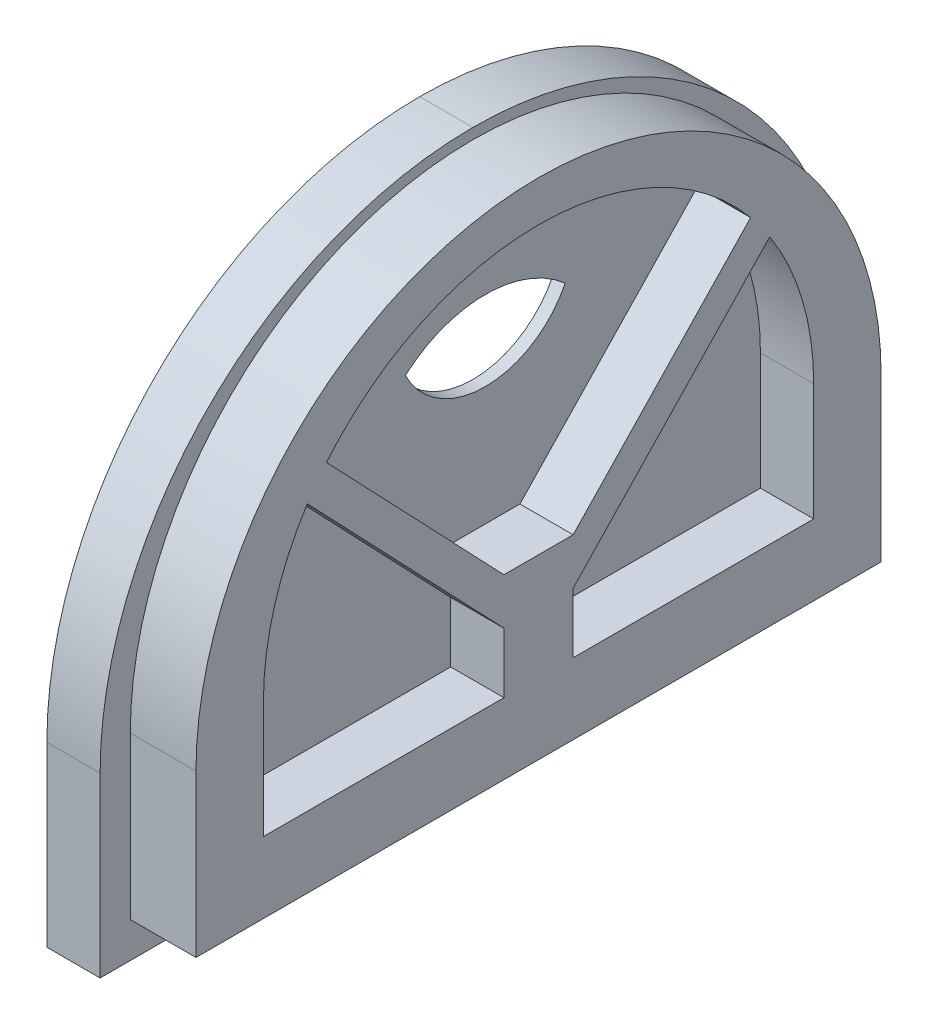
ISO-10303-21;
HEADER;
FILE_DESCRIPTION(('STEP AP214'),'2;1');
FILE_NAME('part.step','',(''),(''),'','','');
FILE_SCHEMA(('AUTOMOTIVE_DESIGN { 1 0 10303 214 1 1 1 1 }'));
ENDSEC;
DATA;
#1=APPLICATION_CONTEXT('core data for automotive mechanical design processes');
#2=APPLICATION_PROTOCOL_DEFINITION('international standard','automotive_design',2000,#1);
#3=PRODUCT_CONTEXT('',#1,'mechanical');
#4=PRODUCT('Part','Part','',(#3));
#5=PRODUCT_RELATED_PRODUCT_CATEGORY('part','',(#4));
#6=PRODUCT_DEFINITION_FORMATION('','',#4);
#7=PRODUCT_DEFINITION_CONTEXT('part definition',#1,'design');
#8=PRODUCT_DEFINITION('design','',#6,#7);
#9=PRODUCT_DEFINITION_SHAPE('','',#8);
#10=(LENGTH_UNIT() NAMED_UNIT(*) SI_UNIT(.MILLI.,.METRE.));
#11=(NAMED_UNIT(*) PLANE_ANGLE_UNIT() SI_UNIT($,.RADIAN.));
#12=(NAMED_UNIT(*) SI_UNIT($,.STERADIAN.) SOLID_ANGLE_UNIT());
#13=UNCERTAINTY_MEASURE_WITH_UNIT(LENGTH_MEASURE(1.E-05),#10,'distance_accuracy_value','');
#14=(GEOMETRIC_REPRESENTATION_CONTEXT(3) GLOBAL_UNCERTAINTY_ASSIGNED_CONTEXT((#13)) GLOBAL_UNIT_ASSIGNED_CONTEXT((#10,
#11,#12)) REPRESENTATION_CONTEXT('',''));
#15=CARTESIAN_POINT('',(0.,0.,0.));
#16=DIRECTION('',(0.,0.,1.));
#17=DIRECTION('',(1.,0.,0.));
#18=AXIS2_PLACEMENT_3D('',#15,#16,#17);
#19=CARTESIAN_POINT('',(3.,-5.1,0.));
#20=DIRECTION('',(1.,0.,0.));
#21=DIRECTION('',(0.,0.,-1.));
#22=AXIS2_PLACEMENT_3D('',#19,#20,#21);
#23=PLANE('',#22);
#24=CARTESIAN_POINT('',(3.,0.89411764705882,0.));
#25=DIRECTION('',(1.,0.,0.));
#26=DIRECTION('',(0.,0.,-1.));
#27=AXIS2_PLACEMENT_3D('',#24,#25,#26);
#28=CIRCLE('',#27,6.80588235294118);
#29=CARTESIAN_POINT('',(3.,6.,-4.5));
#30=VERTEX_POINT('',#29);
#31=CARTESIAN_POINT('',(3.,6.,4.5));
#32=VERTEX_POINT('',#31);
#33=EDGE_CURVE('E287',#30,#32,#28,.T.);
#34=ORIENTED_EDGE('',*,*,#33,.T.);
#35=CARTESIAN_POINT('',(3.,8.21607142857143,0.));
#36=DIRECTION('',(1.,0.,0.));
#37=DIRECTION('',(0.,0.,-1.));
#38=AXIS2_PLACEMENT_3D('',#35,#36,#37);
#39=CIRCLE('',#38,5.01607142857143);
#40=EDGE_CURVE('E285',#32,#30,#39,.T.);
#41=ORIENTED_EDGE('',*,*,#40,.T.);
#42=EDGE_LOOP('',(#34,#41));
#43=FACE_BOUND('',#42,.T.);
#44=CARTESIAN_POINT('',(3.,-5.1,0.));
#45=DIRECTION('',(-1.,0.,0.));
#46=DIRECTION('',(0.,0.,-1.));
#47=AXIS2_PLACEMENT_3D('',#44,#45,#46);
#48=CIRCLE('',#47,16.);
#49=CARTESIAN_POINT('',(3.,6.34752931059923,11.1782857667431));
#50=VERTEX_POINT('',#49);
#51=CARTESIAN_POINT('',(3.,6.34752931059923,-11.1782857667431));
#52=VERTEX_POINT('',#51);
#53=EDGE_CURVE('E438',#50,#52,#48,.T.);
#54=ORIENTED_EDGE('',*,*,#53,.T.);
#55=DIRECTION('',(0.,-0.787301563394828,0.616568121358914));
#56=VECTOR('',#55,1.);
#57=CARTESIAN_POINT('',(3.,-5.5,-1.9));
#58=LINE('',#57,#56);
#59=CARTESIAN_POINT('',(3.,-5.5,-1.9));
#60=VERTEX_POINT('',#59);
#61=EDGE_CURVE('E302',#52,#60,#58,.T.);
#62=ORIENTED_EDGE('',*,*,#61,.T.);
#63=DIRECTION('',(0.,0.,-1.));
#64=VECTOR('',#63,1.);
#65=CARTESIAN_POINT('',(3.,-5.5,-1.9));
#66=LINE('',#65,#64);
#67=CARTESIAN_POINT('',(3.,-5.5,1.9));
#68=VERTEX_POINT('',#67);
#69=EDGE_CURVE('E339',#68,#60,#66,.T.);
#70=ORIENTED_EDGE('',*,*,#69,.F.);
#71=DIRECTION('',(0.,-0.787301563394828,-0.616568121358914));
#72=VECTOR('',#71,1.);
#73=CARTESIAN_POINT('',(3.,-5.5,1.9));
#74=LINE('',#73,#72);
#75=EDGE_CURVE('E324',#50,#68,#74,.T.);
#76=ORIENTED_EDGE('',*,*,#75,.F.);
#77=EDGE_LOOP('',(#54,#62,#70,#76));
#78=FACE_BOUND('',#77,.T.);
#79=ADVANCED_FACE('F34',(#43,#78),#23,.F.);
#80=CARTESIAN_POINT('',(3.,-5.1,0.));
#81=DIRECTION('',(-1.,0.,0.));
#82=DIRECTION('',(0.,0.,1.));
#83=AXIS2_PLACEMENT_3D('',#80,#81,#82);
#84=CYLINDRICAL_SURFACE('',#83,16.);
#85=CARTESIAN_POINT('',(0.,-5.1,0.));
#86=DIRECTION('',(-1.,0.,0.));
#87=DIRECTION('',(0.,0.,-1.));
#88=AXIS2_PLACEMENT_3D('',#85,#86,#87);
#89=CIRCLE('',#88,16.);
#90=CARTESIAN_POINT('',(0.,6.34752931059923,11.1782857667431));
#91=VERTEX_POINT('',#90);
#92=CARTESIAN_POINT('',(0.,6.34752931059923,-11.1782857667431));
#93=VERTEX_POINT('',#92);
#94=EDGE_CURVE('E450',#91,#93,#89,.T.);
#95=ORIENTED_EDGE('',*,*,#94,.T.);
#96=DIRECTION('',(1.,0.,0.));
#97=VECTOR('',#96,1.);
#98=CARTESIAN_POINT('',(0.,6.34752931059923,-11.1782857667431));
#99=LINE('',#98,#97);
#100=EDGE_CURVE('E318',#93,#52,#99,.T.);
#101=ORIENTED_EDGE('',*,*,#100,.T.);
#102=ORIENTED_EDGE('',*,*,#53,.F.);
#103=DIRECTION('',(1.,0.,0.));
#104=VECTOR('',#103,1.);
#105=CARTESIAN_POINT('',(0.,6.34752931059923,11.1782857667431));
#106=LINE('',#105,#104);
#107=EDGE_CURVE('E326',#91,#50,#106,.T.);
#108=ORIENTED_EDGE('',*,*,#107,.F.);
#109=EDGE_LOOP('',(#95,#101,#102,#108));
#110=FACE_BOUND('',#109,.T.);
#111=ADVANCED_FACE('F601',(#110),#84,.F.);
#112=DIRECTION('',(0.,0.787301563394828,0.616568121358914));
#113=VECTOR('',#112,1.);
#114=CARTESIAN_POINT('',(3.,-8.41938544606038,1.9));
#115=LINE('',#114,#113);
#116=CARTESIAN_POINT('',(3.,-8.41938544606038,1.9));
#117=VERTEX_POINT('',#116);
#118=CARTESIAN_POINT('',(3.,5.,12.4092707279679));
#119=VERTEX_POINT('',#118);
#120=EDGE_CURVE('E320',#117,#119,#115,.T.);
#121=ORIENTED_EDGE('',*,*,#120,.F.);
#122=DIRECTION('',(0.,1.,0.));
#123=VECTOR('',#122,1.);
#124=CARTESIAN_POINT('',(3.,-10.5,1.9));
#125=LINE('',#124,#123);
#126=CARTESIAN_POINT('',(3.,-10.5,1.9));
#127=VERTEX_POINT('',#126);
#128=EDGE_CURVE('E346',#127,#117,#125,.T.);
#129=ORIENTED_EDGE('',*,*,#128,.F.);
#130=DIRECTION('',(0.,0.,1.));
#131=VECTOR('',#130,1.);
#132=CARTESIAN_POINT('',(3.,-10.5,-16.));
#133=LINE('',#132,#131);
#134=CARTESIAN_POINT('',(3.,-10.5,16.));
#135=VERTEX_POINT('',#134);
#136=EDGE_CURVE('E425',#127,#135,#133,.T.);
#137=ORIENTED_EDGE('',*,*,#136,.T.);
#138=DIRECTION('',(0.,1.,0.));
#139=VECTOR('',#138,1.);
#140=CARTESIAN_POINT('',(3.,-5.1,16.));
#141=LINE('',#140,#139);
#142=CARTESIAN_POINT('',(3.,-5.1,16.));
#143=VERTEX_POINT('',#142);
#144=EDGE_CURVE('E430',#135,#143,#141,.T.);
#145=ORIENTED_EDGE('',*,*,#144,.T.);
#146=EDGE_CURVE('E434',#143,#119,#48,.T.);
#147=ORIENTED_EDGE('',*,*,#146,.T.);
#148=EDGE_LOOP('',(#121,#129,#137,#145,#147));
#149=FACE_BOUND('',#148,.T.);
#150=ADVANCED_FACE('F605',(#149),#23,.F.);
#151=DIRECTION('',(0.,-1.,0.));
#152=VECTOR('',#151,1.);
#153=CARTESIAN_POINT('',(3.,-10.5,-1.9));
#154=LINE('',#153,#152);
#155=CARTESIAN_POINT('',(3.,-8.41938544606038,-1.9));
#156=VERTEX_POINT('',#155);
#157=CARTESIAN_POINT('',(3.,-10.5,-1.9));
#158=VERTEX_POINT('',#157);
#159=EDGE_CURVE('E335',#156,#158,#154,.T.);
#160=ORIENTED_EDGE('',*,*,#159,.F.);
#161=DIRECTION('',(0.,0.787301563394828,-0.616568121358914));
#162=VECTOR('',#161,1.);
#163=CARTESIAN_POINT('',(3.,-8.41938544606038,-1.9));
#164=LINE('',#163,#162);
#165=CARTESIAN_POINT('',(3.,5.,-12.4092707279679));
#166=VERTEX_POINT('',#165);
#167=EDGE_CURVE('E307',#156,#166,#164,.T.);
#168=ORIENTED_EDGE('',*,*,#167,.T.);
#169=CARTESIAN_POINT('',(3.,-5.1,-16.));
#170=VERTEX_POINT('',#169);
#171=EDGE_CURVE('E433',#166,#170,#48,.T.);
#172=ORIENTED_EDGE('',*,*,#171,.T.);
#173=DIRECTION('',(0.,-1.,0.));
#174=VECTOR('',#173,1.);
#175=CARTESIAN_POINT('',(3.,-10.5,-16.));
#176=LINE('',#175,#174);
#177=CARTESIAN_POINT('',(3.,-10.5,-16.));
#178=VERTEX_POINT('',#177);
#179=EDGE_CURVE('E422',#170,#178,#176,.T.);
#180=ORIENTED_EDGE('',*,*,#179,.T.);
#181=EDGE_CURVE('E427',#178,#158,#133,.T.);
#182=ORIENTED_EDGE('',*,*,#181,.T.);
#183=EDGE_LOOP('',(#160,#168,#172,#180,#182));
#184=FACE_BOUND('',#183,.T.);
#185=ADVANCED_FACE('F604',(#184),#23,.F.);
#186=DIRECTION('',(1.,0.,0.));
#187=VECTOR('',#186,1.);
#188=CARTESIAN_POINT('',(0.,5.,12.4092707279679));
#189=LINE('',#188,#187);
#190=CARTESIAN_POINT('',(0.,5.,12.4092707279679));
#191=VERTEX_POINT('',#190);
#192=EDGE_CURVE('E330',#191,#119,#189,.T.);
#193=ORIENTED_EDGE('',*,*,#192,.T.);
#194=ORIENTED_EDGE('',*,*,#146,.F.);
#195=DIRECTION('',(-1.,0.,0.));
#196=VECTOR('',#195,1.);
#197=CARTESIAN_POINT('',(3.,-5.1,16.));
#198=LINE('',#197,#196);
#199=CARTESIAN_POINT('',(0.,-5.1,16.));
#200=VERTEX_POINT('',#199);
#201=EDGE_CURVE('E455',#143,#200,#198,.T.);
#202=ORIENTED_EDGE('',*,*,#201,.T.);
#203=EDGE_CURVE('E426',#200,#191,#89,.T.);
#204=ORIENTED_EDGE('',*,*,#203,.T.);
#205=EDGE_LOOP('',(#193,#194,#202,#204));
#206=FACE_BOUND('',#205,.T.);
#207=ADVANCED_FACE('F612',(#206),#84,.F.);
#208=ORIENTED_EDGE('',*,*,#171,.F.);
#209=DIRECTION('',(1.,0.,0.));
#210=VECTOR('',#209,1.);
#211=CARTESIAN_POINT('',(0.,5.,-12.4092707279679));
#212=LINE('',#211,#210);
#213=CARTESIAN_POINT('',(0.,5.,-12.4092707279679));
#214=VERTEX_POINT('',#213);
#215=EDGE_CURVE('E315',#214,#166,#212,.T.);
#216=ORIENTED_EDGE('',*,*,#215,.F.);
#217=CARTESIAN_POINT('',(0.,-5.1,-16.));
#218=VERTEX_POINT('',#217);
#219=EDGE_CURVE('E447',#214,#218,#89,.T.);
#220=ORIENTED_EDGE('',*,*,#219,.T.);
#221=DIRECTION('',(-1.,0.,0.));
#222=VECTOR('',#221,1.);
#223=CARTESIAN_POINT('',(3.,-5.1,-16.));
#224=LINE('',#223,#222);
#225=EDGE_CURVE('E451',#170,#218,#224,.T.);
#226=ORIENTED_EDGE('',*,*,#225,.F.);
#227=EDGE_LOOP('',(#208,#216,#220,#226));
#228=FACE_BOUND('',#227,.T.);
#229=ADVANCED_FACE('F611',(#228),#84,.F.);
#230=CARTESIAN_POINT('',(0.,-10.5,1.9));
#231=DIRECTION('',(0.,0.,-1.));
#232=DIRECTION('',(0.,1.,0.));
#233=AXIS2_PLACEMENT_3D('',#230,#231,#232);
#234=PLANE('',#233);
#235=DIRECTION('',(1.,0.,0.));
#236=VECTOR('',#235,1.);
#237=CARTESIAN_POINT('',(0.,-8.41938544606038,1.9));
#238=LINE('',#237,#236);
#239=CARTESIAN_POINT('',(0.,-8.41938544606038,1.9));
#240=VERTEX_POINT('',#239);
#241=EDGE_CURVE('E333',#240,#117,#238,.T.);
#242=ORIENTED_EDGE('',*,*,#241,.F.);
#243=DIRECTION('',(0.,1.,0.));
#244=VECTOR('',#243,1.);
#245=CARTESIAN_POINT('',(0.,-10.5,1.9));
#246=LINE('',#245,#244);
#247=CARTESIAN_POINT('',(0.,-10.5,1.9));
#248=VERTEX_POINT('',#247);
#249=EDGE_CURVE('E338',#248,#240,#246,.T.);
#250=ORIENTED_EDGE('',*,*,#249,.F.);
#251=DIRECTION('',(1.,0.,0.));
#252=VECTOR('',#251,1.);
#253=CARTESIAN_POINT('',(0.,-10.5,1.9));
#254=LINE('',#253,#252);
#255=EDGE_CURVE('E355',#248,#127,#254,.T.);
#256=ORIENTED_EDGE('',*,*,#255,.T.);
#257=ORIENTED_EDGE('',*,*,#128,.T.);
#258=EDGE_LOOP('',(#242,#250,#256,#257));
#259=FACE_BOUND('',#258,.T.);
#260=ADVANCED_FACE('F628',(#259),#234,.F.);
#261=CARTESIAN_POINT('',(3.,-10.5,-16.));
#262=DIRECTION('',(0.,-1.,0.));
#263=DIRECTION('',(0.,0.,-1.));
#264=AXIS2_PLACEMENT_3D('',#261,#262,#263);
#265=PLANE('',#264);
#266=DIRECTION('',(1.,0.,0.));
#267=VECTOR('',#266,1.);
#268=CARTESIAN_POINT('',(0.,-10.5,-1.9));
#269=LINE('',#268,#267);
#270=CARTESIAN_POINT('',(0.,-10.5,-1.9));
#271=VERTEX_POINT('',#270);
#272=EDGE_CURVE('E358',#271,#158,#269,.T.);
#273=ORIENTED_EDGE('',*,*,#272,.T.);
#274=ORIENTED_EDGE('',*,*,#181,.F.);
#275=DIRECTION('',(-1.,0.,0.));
#276=VECTOR('',#275,1.);
#277=CARTESIAN_POINT('',(3.,-10.5,-16.));
#278=LINE('',#277,#276);
#279=CARTESIAN_POINT('',(0.,-10.5,-16.));
#280=VERTEX_POINT('',#279);
#281=EDGE_CURVE('E437',#178,#280,#278,.T.);
#282=ORIENTED_EDGE('',*,*,#281,.T.);
#283=DIRECTION('',(0.,0.,1.));
#284=VECTOR('',#283,1.);
#285=CARTESIAN_POINT('',(0.,-10.5,-16.));
#286=LINE('',#285,#284);
#287=EDGE_CURVE('E441',#280,#271,#286,.T.);
#288=ORIENTED_EDGE('',*,*,#287,.T.);
#289=EDGE_LOOP('',(#273,#274,#282,#288));
#290=FACE_BOUND('',#289,.T.);
#291=ADVANCED_FACE('F660',(#290),#265,.F.);
#292=ORIENTED_EDGE('',*,*,#255,.F.);
#293=CARTESIAN_POINT('',(0.,-10.5,16.));
#294=VERTEX_POINT('',#293);
#295=EDGE_CURVE('E440',#248,#294,#286,.T.);
#296=ORIENTED_EDGE('',*,*,#295,.T.);
#297=DIRECTION('',(-1.,0.,0.));
#298=VECTOR('',#297,1.);
#299=CARTESIAN_POINT('',(3.,-10.5,16.));
#300=LINE('',#299,#298);
#301=EDGE_CURVE('E457',#135,#294,#300,.T.);
#302=ORIENTED_EDGE('',*,*,#301,.F.);
#303=ORIENTED_EDGE('',*,*,#136,.F.);
#304=EDGE_LOOP('',(#292,#296,#302,#303));
#305=FACE_BOUND('',#304,.T.);
#306=ADVANCED_FACE('F632',(#305),#265,.F.);
#307=CARTESIAN_POINT('',(3.7,-2.9,0.));
#308=DIRECTION('',(-1.,0.,0.));
#309=DIRECTION('',(0.,0.,1.));
#310=AXIS2_PLACEMENT_3D('',#307,#308,#309);
#311=PLANE('',#310);
#312=CARTESIAN_POINT('',(3.7,0.89411764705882,0.));
#313=DIRECTION('',(1.,0.,0.));
#314=DIRECTION('',(0.,0.,1.));
#315=AXIS2_PLACEMENT_3D('',#312,#313,#314);
#316=CIRCLE('',#315,6.80588235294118);
#317=CARTESIAN_POINT('',(3.7,6.,-4.5));
#318=VERTEX_POINT('',#317);
#319=CARTESIAN_POINT('',(3.7,6.,4.5));
#320=VERTEX_POINT('',#319);
#321=EDGE_CURVE('E291',#318,#320,#316,.T.);
#322=ORIENTED_EDGE('',*,*,#321,.F.);
#323=CARTESIAN_POINT('',(3.7,8.21607142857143,0.));
#324=DIRECTION('',(1.,0.,0.));
#325=DIRECTION('',(0.,0.,-1.));
#326=AXIS2_PLACEMENT_3D('',#323,#324,#325);
#327=CIRCLE('',#326,5.01607142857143);
#328=EDGE_CURVE('E57',#320,#318,#327,.T.);
#329=ORIENTED_EDGE('',*,*,#328,.F.);
#330=EDGE_LOOP('',(#322,#329));
#331=FACE_BOUND('',#330,.T.);
#332=CARTESIAN_POINT('',(3.7,-2.9,0.));
#333=DIRECTION('',(1.,0.,0.));
#334=DIRECTION('',(0.,0.,1.));
#335=AXIS2_PLACEMENT_3D('',#332,#333,#334);
#336=CIRCLE('',#335,15.5);
#337=CARTESIAN_POINT('',(3.7,6.97564553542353,-11.9466156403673));
#338=VERTEX_POINT('',#337);
#339=CARTESIAN_POINT('',(3.7,6.97564553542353,11.9466156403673));
#340=VERTEX_POINT('',#339);
#341=EDGE_CURVE('E478',#338,#340,#336,.T.);
#342=ORIENTED_EDGE('',*,*,#341,.T.);
#343=DIRECTION('',(0.,-0.723454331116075,-0.690372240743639));
#344=VECTOR('',#343,1.);
#345=CARTESIAN_POINT('',(3.7,-3.5,1.95));
#346=LINE('',#345,#344);
#347=CARTESIAN_POINT('',(3.7,-3.5,1.95));
#348=VERTEX_POINT('',#347);
#349=EDGE_CURVE('E361',#340,#348,#346,.T.);
#350=ORIENTED_EDGE('',*,*,#349,.T.);
#351=DIRECTION('',(0.,0.,1.));
#352=VECTOR('',#351,1.);
#353=CARTESIAN_POINT('',(3.7,-3.5,1.95));
#354=LINE('',#353,#352);
#355=CARTESIAN_POINT('',(3.7,-3.5,-1.95));
#356=VERTEX_POINT('',#355);
#357=EDGE_CURVE('E407',#356,#348,#354,.T.);
#358=ORIENTED_EDGE('',*,*,#357,.F.);
#359=DIRECTION('',(0.,-0.723454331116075,0.690372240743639));
#360=VECTOR('',#359,1.);
#361=CARTESIAN_POINT('',(3.7,-3.5,-1.95));
#362=LINE('',#361,#360);
#363=EDGE_CURVE('E383',#338,#356,#362,.T.);
#364=ORIENTED_EDGE('',*,*,#363,.F.);
#365=EDGE_LOOP('',(#342,#350,#358,#364));
#366=FACE_BOUND('',#365,.T.);
#367=ADVANCED_FACE('F295',(#331,#366),#311,.F.);
#368=CARTESIAN_POINT('',(3.7,-2.9,0.));
#369=DIRECTION('',(1.,0.,0.));
#370=DIRECTION('',(0.,0.,-1.));
#371=AXIS2_PLACEMENT_3D('',#368,#369,#370);
#372=CYLINDRICAL_SURFACE('',#371,15.5);
#373=CARTESIAN_POINT('',(6.7,-2.9,0.));
#374=DIRECTION('',(1.,0.,0.));
#375=DIRECTION('',(0.,0.,1.));
#376=AXIS2_PLACEMENT_3D('',#373,#374,#375);
#377=CIRCLE('',#376,15.5);
#378=CARTESIAN_POINT('',(6.7,6.97564553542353,-11.9466156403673));
#379=VERTEX_POINT('',#378);
#380=CARTESIAN_POINT('',(6.7,6.97564553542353,11.9466156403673));
#381=VERTEX_POINT('',#380);
#382=EDGE_CURVE('E490',#379,#381,#377,.T.);
#383=ORIENTED_EDGE('',*,*,#382,.T.);
#384=DIRECTION('',(-1.,0.,0.));
#385=VECTOR('',#384,1.);
#386=CARTESIAN_POINT('',(6.7,6.97564553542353,11.9466156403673));
#387=LINE('',#386,#385);
#388=EDGE_CURVE('E376',#381,#340,#387,.T.);
#389=ORIENTED_EDGE('',*,*,#388,.T.);
#390=ORIENTED_EDGE('',*,*,#341,.F.);
#391=DIRECTION('',(-1.,0.,0.));
#392=VECTOR('',#391,1.);
#393=CARTESIAN_POINT('',(6.7,6.97564553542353,-11.9466156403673));
#394=LINE('',#393,#392);
#395=EDGE_CURVE('E385',#379,#338,#394,.T.);
#396=ORIENTED_EDGE('',*,*,#395,.F.);
#397=EDGE_LOOP('',(#383,#389,#390,#396));
#398=FACE_BOUND('',#397,.T.);
#399=ADVANCED_FACE('F702',(#398),#372,.F.);
#400=DIRECTION('',(0.,0.723454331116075,-0.690372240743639));
#401=VECTOR('',#400,1.);
#402=CARTESIAN_POINT('',(3.7,-6.10728907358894,-1.95));
#403=LINE('',#402,#401);
#404=CARTESIAN_POINT('',(3.7,-6.10728907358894,-1.95));
#405=VERTEX_POINT('',#404);
#406=CARTESIAN_POINT('',(3.7,5.5,-13.0265114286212));
#407=VERTEX_POINT('',#406);
#408=EDGE_CURVE('E379',#405,#407,#403,.T.);
#409=ORIENTED_EDGE('',*,*,#408,.F.);
#410=DIRECTION('',(0.,1.,0.));
#411=VECTOR('',#410,1.);
#412=CARTESIAN_POINT('',(3.7,-3.5,-1.95));
#413=LINE('',#412,#411);
#414=CARTESIAN_POINT('',(3.7,-9.5,-1.95));
#415=VERTEX_POINT('',#414);
#416=EDGE_CURVE('E394',#415,#405,#413,.T.);
#417=ORIENTED_EDGE('',*,*,#416,.F.);
#418=DIRECTION('',(0.,0.,-1.));
#419=VECTOR('',#418,1.);
#420=CARTESIAN_POINT('',(3.7,-9.5,15.5));
#421=LINE('',#420,#419);
#422=CARTESIAN_POINT('',(3.7,-9.5,-15.5));
#423=VERTEX_POINT('',#422);
#424=EDGE_CURVE('E465',#415,#423,#421,.T.);
#425=ORIENTED_EDGE('',*,*,#424,.T.);
#426=DIRECTION('',(0.,1.,0.));
#427=VECTOR('',#426,1.);
#428=CARTESIAN_POINT('',(3.7,-2.9,-15.5));
#429=LINE('',#428,#427);
#430=CARTESIAN_POINT('',(3.7,-2.9,-15.5));
#431=VERTEX_POINT('',#430);
#432=EDGE_CURVE('E470',#423,#431,#429,.T.);
#433=ORIENTED_EDGE('',*,*,#432,.T.);
#434=EDGE_CURVE('E474',#431,#407,#336,.T.);
#435=ORIENTED_EDGE('',*,*,#434,.T.);
#436=EDGE_LOOP('',(#409,#417,#425,#433,#435));
#437=FACE_BOUND('',#436,.T.);
#438=ADVANCED_FACE('F720',(#437),#311,.F.);
#439=DIRECTION('',(0.,-1.,0.));
#440=VECTOR('',#439,1.);
#441=CARTESIAN_POINT('',(3.7,-9.5,1.95));
#442=LINE('',#441,#440);
#443=CARTESIAN_POINT('',(3.7,-6.10728907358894,1.95));
#444=VERTEX_POINT('',#443);
#445=CARTESIAN_POINT('',(3.7,-9.5,1.95));
#446=VERTEX_POINT('',#445);
#447=EDGE_CURVE('E399',#444,#446,#442,.T.);
#448=ORIENTED_EDGE('',*,*,#447,.F.);
#449=DIRECTION('',(0.,0.723454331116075,0.690372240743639));
#450=VECTOR('',#449,1.);
#451=CARTESIAN_POINT('',(3.7,-6.10728907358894,1.95));
#452=LINE('',#451,#450);
#453=CARTESIAN_POINT('',(3.7,5.5,13.0265114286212));
#454=VERTEX_POINT('',#453);
#455=EDGE_CURVE('E365',#444,#454,#452,.T.);
#456=ORIENTED_EDGE('',*,*,#455,.T.);
#457=CARTESIAN_POINT('',(3.7,-2.9,15.5));
#458=VERTEX_POINT('',#457);
#459=EDGE_CURVE('E473',#454,#458,#336,.T.);
#460=ORIENTED_EDGE('',*,*,#459,.T.);
#461=DIRECTION('',(0.,-1.,0.));
#462=VECTOR('',#461,1.);
#463=CARTESIAN_POINT('',(3.7,-9.5,15.5));
#464=LINE('',#463,#462);
#465=CARTESIAN_POINT('',(3.7,-9.5,15.5));
#466=VERTEX_POINT('',#465);
#467=EDGE_CURVE('E462',#458,#466,#464,.T.);
#468=ORIENTED_EDGE('',*,*,#467,.T.);
#469=EDGE_CURVE('E467',#466,#446,#421,.T.);
#470=ORIENTED_EDGE('',*,*,#469,.T.);
#471=EDGE_LOOP('',(#448,#456,#460,#468,#470));
#472=FACE_BOUND('',#471,.T.);
#473=ADVANCED_FACE('F723',(#472),#311,.F.);
#474=DIRECTION('',(-1.,0.,0.));
#475=VECTOR('',#474,1.);
#476=CARTESIAN_POINT('',(6.7,5.5,-13.0265114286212));
#477=LINE('',#476,#475);
#478=CARTESIAN_POINT('',(6.7,5.5,-13.0265114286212));
#479=VERTEX_POINT('',#478);
#480=EDGE_CURVE('E389',#479,#407,#477,.T.);
#481=ORIENTED_EDGE('',*,*,#480,.T.);
#482=ORIENTED_EDGE('',*,*,#434,.F.);
#483=DIRECTION('',(1.,0.,0.));
#484=VECTOR('',#483,1.);
#485=CARTESIAN_POINT('',(3.7,-2.9,-15.5));
#486=LINE('',#485,#484);
#487=CARTESIAN_POINT('',(6.7,-2.9,-15.5));
#488=VERTEX_POINT('',#487);
#489=EDGE_CURVE('E495',#431,#488,#486,.T.);
#490=ORIENTED_EDGE('',*,*,#489,.T.);
#491=EDGE_CURVE('E466',#488,#479,#377,.T.);
#492=ORIENTED_EDGE('',*,*,#491,.T.);
#493=EDGE_LOOP('',(#481,#482,#490,#492));
#494=FACE_BOUND('',#493,.T.);
#495=ADVANCED_FACE('F699',(#494),#372,.F.);
#496=ORIENTED_EDGE('',*,*,#459,.F.);
#497=DIRECTION('',(-1.,0.,0.));
#498=VECTOR('',#497,1.);
#499=CARTESIAN_POINT('',(6.7,5.5,13.0265114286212));
#500=LINE('',#499,#498);
#501=CARTESIAN_POINT('',(6.7,5.5,13.0265114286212));
#502=VERTEX_POINT('',#501);
#503=EDGE_CURVE('E374',#502,#454,#500,.T.);
#504=ORIENTED_EDGE('',*,*,#503,.F.);
#505=CARTESIAN_POINT('',(6.7,-2.9,15.5));
#506=VERTEX_POINT('',#505);
#507=EDGE_CURVE('E487',#502,#506,#377,.T.);
#508=ORIENTED_EDGE('',*,*,#507,.T.);
#509=DIRECTION('',(1.,0.,0.));
#510=VECTOR('',#509,1.);
#511=CARTESIAN_POINT('',(3.7,-2.9,15.5));
#512=LINE('',#511,#510);
#513=EDGE_CURVE('E491',#458,#506,#512,.T.);
#514=ORIENTED_EDGE('',*,*,#513,.F.);
#515=EDGE_LOOP('',(#496,#504,#508,#514));
#516=FACE_BOUND('',#515,.T.);
#517=ADVANCED_FACE('F690',(#516),#372,.F.);
#518=CARTESIAN_POINT('',(6.7,-3.5,-1.95));
#519=DIRECTION('',(0.,0.,1.));
#520=DIRECTION('',(0.,-1.,0.));
#521=AXIS2_PLACEMENT_3D('',#518,#519,#520);
#522=PLANE('',#521);
#523=DIRECTION('',(-1.,0.,0.));
#524=VECTOR('',#523,1.);
#525=CARTESIAN_POINT('',(6.7,-6.10728907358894,-1.95));
#526=LINE('',#525,#524);
#527=CARTESIAN_POINT('',(6.7,-6.10728907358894,-1.95));
#528=VERTEX_POINT('',#527);
#529=EDGE_CURVE('E392',#528,#405,#526,.T.);
#530=ORIENTED_EDGE('',*,*,#529,.F.);
#531=DIRECTION('',(0.,1.,0.));
#532=VECTOR('',#531,1.);
#533=CARTESIAN_POINT('',(6.7,-3.5,-1.95));
#534=LINE('',#533,#532);
#535=CARTESIAN_POINT('',(6.7,-9.5,-1.95));
#536=VERTEX_POINT('',#535);
#537=EDGE_CURVE('E395',#536,#528,#534,.T.);
#538=ORIENTED_EDGE('',*,*,#537,.F.);
#539=DIRECTION('',(-1.,0.,0.));
#540=VECTOR('',#539,1.);
#541=CARTESIAN_POINT('',(6.7,-9.5,-1.95));
#542=LINE('',#541,#540);
#543=EDGE_CURVE('E418',#536,#415,#542,.T.);
#544=ORIENTED_EDGE('',*,*,#543,.T.);
#545=ORIENTED_EDGE('',*,*,#416,.T.);
#546=EDGE_LOOP('',(#530,#538,#544,#545));
#547=FACE_BOUND('',#546,.T.);
#548=ADVANCED_FACE('F687',(#547),#522,.F.);
#549=CARTESIAN_POINT('',(3.7,-9.5,15.5));
#550=DIRECTION('',(0.,-1.,0.));
#551=DIRECTION('',(0.,0.,-1.));
#552=AXIS2_PLACEMENT_3D('',#549,#550,#551);
#553=PLANE('',#552);
#554=ORIENTED_EDGE('',*,*,#543,.F.);
#555=DIRECTION('',(0.,0.,-1.));
#556=VECTOR('',#555,1.);
#557=CARTESIAN_POINT('',(6.7,-9.5,15.5));
#558=LINE('',#557,#556);
#559=CARTESIAN_POINT('',(6.7,-9.5,-15.5));
#560=VERTEX_POINT('',#559);
#561=EDGE_CURVE('E480',#536,#560,#558,.T.);
#562=ORIENTED_EDGE('',*,*,#561,.T.);
#563=DIRECTION('',(1.,0.,0.));
#564=VECTOR('',#563,1.);
#565=CARTESIAN_POINT('',(3.7,-9.5,-15.5));
#566=LINE('',#565,#564);
#567=EDGE_CURVE('E497',#423,#560,#566,.T.);
#568=ORIENTED_EDGE('',*,*,#567,.F.);
#569=ORIENTED_EDGE('',*,*,#424,.F.);
#570=EDGE_LOOP('',(#554,#562,#568,#569));
#571=FACE_BOUND('',#570,.T.);
#572=ADVANCED_FACE('F689',(#571),#553,.F.);
#573=DIRECTION('',(-1.,0.,0.));
#574=VECTOR('',#573,1.);
#575=CARTESIAN_POINT('',(6.7,-9.5,1.95));
#576=LINE('',#575,#574);
#577=CARTESIAN_POINT('',(6.7,-9.5,1.95));
#578=VERTEX_POINT('',#577);
#579=EDGE_CURVE('E404',#578,#446,#576,.T.);
#580=ORIENTED_EDGE('',*,*,#579,.T.);
#581=ORIENTED_EDGE('',*,*,#469,.F.);
#582=DIRECTION('',(1.,0.,0.));
#583=VECTOR('',#582,1.);
#584=CARTESIAN_POINT('',(3.7,-9.5,15.5));
#585=LINE('',#584,#583);
#586=CARTESIAN_POINT('',(6.7,-9.5,15.5));
#587=VERTEX_POINT('',#586);
#588=EDGE_CURVE('E477',#466,#587,#585,.T.);
#589=ORIENTED_EDGE('',*,*,#588,.T.);
#590=EDGE_CURVE('E481',#587,#578,#558,.T.);
#591=ORIENTED_EDGE('',*,*,#590,.T.);
#592=EDGE_LOOP('',(#580,#581,#589,#591));
#593=FACE_BOUND('',#592,.T.);
#594=ADVANCED_FACE('F696',(#593),#553,.F.);
#595=CARTESIAN_POINT('',(3.,0.,0.));
#596=DIRECTION('',(-1.,0.,0.));
#597=DIRECTION('',(0.,0.,1.));
#598=AXIS2_PLACEMENT_3D('',#595,#596,#597);
#599=PLANE('',#598);
#600=DIRECTION('',(0.,1.,0.));
#601=VECTOR('',#600,1.);
#602=CARTESIAN_POINT('',(3.,-15.5,-21.));
#603=LINE('',#602,#601);
#604=CARTESIAN_POINT('',(3.,-15.5,-21.));
#605=VERTEX_POINT('',#604);
#606=CARTESIAN_POINT('',(3.,-5.5,-21.));
#607=VERTEX_POINT('',#606);
#608=EDGE_CURVE('E534',#605,#607,#603,.T.);
#609=ORIENTED_EDGE('',*,*,#608,.T.);
#610=CARTESIAN_POINT('',(3.,-5.5,0.));
#611=DIRECTION('',(-1.,0.,0.));
#612=DIRECTION('',(0.,0.,1.));
#613=AXIS2_PLACEMENT_3D('',#610,#611,#612);
#614=CIRCLE('',#613,21.);
#615=CARTESIAN_POINT('',(3.,15.5,0.));
#616=VERTEX_POINT('',#615);
#617=EDGE_CURVE('E43',#607,#616,#614,.F.);
#618=ORIENTED_EDGE('',*,*,#617,.T.);
#619=CARTESIAN_POINT('',(3.,-5.5,0.));
#620=DIRECTION('',(-1.,0.,0.));
#621=DIRECTION('',(0.,0.,1.));
#622=AXIS2_PLACEMENT_3D('',#619,#620,#621);
#623=CIRCLE('',#622,21.);
#624=CARTESIAN_POINT('',(3.,-5.5,21.));
#625=VERTEX_POINT('',#624);
#626=EDGE_CURVE('E561',#616,#625,#623,.F.);
#627=ORIENTED_EDGE('',*,*,#626,.T.);
#628=DIRECTION('',(0.,-1.,0.));
#629=VECTOR('',#628,1.);
#630=CARTESIAN_POINT('',(3.,-15.5,21.));
#631=LINE('',#630,#629);
#632=CARTESIAN_POINT('',(3.,-15.5,21.));
#633=VERTEX_POINT('',#632);
#634=EDGE_CURVE('E537',#625,#633,#631,.T.);
#635=ORIENTED_EDGE('',*,*,#634,.T.);
#636=DIRECTION('',(0.,0.,-1.));
#637=VECTOR('',#636,1.);
#638=CARTESIAN_POINT('',(3.,-15.5,21.));
#639=LINE('',#638,#637);
#640=EDGE_CURVE('E540',#633,#605,#639,.T.);
#641=ORIENTED_EDGE('',*,*,#640,.T.);
#642=EDGE_LOOP('',(#609,#618,#627,#635,#641));
#643=FACE_BOUND('',#642,.T.);
#644=DIRECTION('',(0.,-1.,0.));
#645=VECTOR('',#644,1.);
#646=CARTESIAN_POINT('',(3.,-13.5,19.3));
#647=LINE('',#646,#645);
#648=CARTESIAN_POINT('',(3.,-4.40000000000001,19.3));
#649=VERTEX_POINT('',#648);
#650=CARTESIAN_POINT('',(3.,-13.5,19.3));
#651=VERTEX_POINT('',#650);
#652=EDGE_CURVE('E494',#649,#651,#647,.T.);
#653=ORIENTED_EDGE('',*,*,#652,.F.);
#654=CARTESIAN_POINT('',(3.,-4.40000000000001,0.));
#655=DIRECTION('',(1.,0.,0.));
#656=DIRECTION('',(0.,0.,1.));
#657=AXIS2_PLACEMENT_3D('',#654,#655,#656);
#658=CIRCLE('',#657,19.3);
#659=CARTESIAN_POINT('',(3.,-4.40000000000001,-19.3));
#660=VERTEX_POINT('',#659);
#661=EDGE_CURVE('E506',#660,#649,#658,.T.);
#662=ORIENTED_EDGE('',*,*,#661,.F.);
#663=DIRECTION('',(0.,1.,0.));
#664=VECTOR('',#663,1.);
#665=CARTESIAN_POINT('',(3.,-4.40000000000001,-19.3));
#666=LINE('',#665,#664);
#667=CARTESIAN_POINT('',(3.,-13.5,-19.3));
#668=VERTEX_POINT('',#667);
#669=EDGE_CURVE('E518',#668,#660,#666,.T.);
#670=ORIENTED_EDGE('',*,*,#669,.F.);
#671=DIRECTION('',(0.,0.,-1.));
#672=VECTOR('',#671,1.);
#673=CARTESIAN_POINT('',(3.,-13.5,19.3));
#674=LINE('',#673,#672);
#675=EDGE_CURVE('E515',#651,#668,#674,.T.);
#676=ORIENTED_EDGE('',*,*,#675,.F.);
#677=EDGE_LOOP('',(#653,#662,#670,#676));
#678=FACE_BOUND('',#677,.T.);
#679=ADVANCED_FACE('F565',(#643,#678),#599,.F.);
#680=CARTESIAN_POINT('',(3.,-15.5,-21.));
#681=DIRECTION('',(0.,0.,1.));
#682=DIRECTION('',(1.,0.,0.));
#683=AXIS2_PLACEMENT_3D('',#680,#681,#682);
#684=PLANE('',#683);
#685=DIRECTION('',(0.,1.,0.));
#686=VECTOR('',#685,1.);
#687=CARTESIAN_POINT('',(0.,-15.5,-21.));
#688=LINE('',#687,#686);
#689=CARTESIAN_POINT('',(0.,-15.5,-21.));
#690=VERTEX_POINT('',#689);
#691=CARTESIAN_POINT('',(0.,-5.5,-21.));
#692=VERTEX_POINT('',#691);
#693=EDGE_CURVE('E543',#690,#692,#688,.T.);
#694=ORIENTED_EDGE('',*,*,#693,.T.);
#695=DIRECTION('',(-1.,0.,0.));
#696=VECTOR('',#695,1.);
#697=CARTESIAN_POINT('',(3.,-5.5,-21.));
#698=LINE('',#697,#696);
#699=EDGE_CURVE('E558',#692,#607,#698,.F.);
#700=ORIENTED_EDGE('',*,*,#699,.T.);
#701=ORIENTED_EDGE('',*,*,#608,.F.);
#702=DIRECTION('',(-1.,0.,0.));
#703=VECTOR('',#702,1.);
#704=CARTESIAN_POINT('',(3.,-15.5,-21.));
#705=LINE('',#704,#703);
#706=EDGE_CURVE('E542',#605,#690,#705,.T.);
#707=ORIENTED_EDGE('',*,*,#706,.T.);
#708=EDGE_LOOP('',(#694,#700,#701,#707));
#709=FACE_BOUND('',#708,.T.);
#710=ADVANCED_FACE('F584',(#709),#684,.F.);
#711=CARTESIAN_POINT('',(3.,-15.5,21.));
#712=DIRECTION('',(0.,0.,-1.));
#713=DIRECTION('',(-1.,0.,0.));
#714=AXIS2_PLACEMENT_3D('',#711,#712,#713);
#715=PLANE('',#714);
#716=ORIENTED_EDGE('',*,*,#634,.F.);
#717=DIRECTION('',(-1.,0.,0.));
#718=VECTOR('',#717,1.);
#719=CARTESIAN_POINT('',(3.,-5.5,21.));
#720=LINE('',#719,#718);
#721=CARTESIAN_POINT('',(0.,-5.5,21.));
#722=VERTEX_POINT('',#721);
#723=EDGE_CURVE('E11',#625,#722,#720,.T.);
#724=ORIENTED_EDGE('',*,*,#723,.T.);
#725=DIRECTION('',(0.,-1.,0.));
#726=VECTOR('',#725,1.);
#727=CARTESIAN_POINT('',(0.,-15.5,21.));
#728=LINE('',#727,#726);
#729=CARTESIAN_POINT('',(0.,-15.5,21.));
#730=VERTEX_POINT('',#729);
#731=EDGE_CURVE('E546',#722,#730,#728,.T.);
#732=ORIENTED_EDGE('',*,*,#731,.T.);
#733=DIRECTION('',(-1.,0.,0.));
#734=VECTOR('',#733,1.);
#735=CARTESIAN_POINT('',(3.,-15.5,21.));
#736=LINE('',#735,#734);
#737=EDGE_CURVE('E551',#633,#730,#736,.T.);
#738=ORIENTED_EDGE('',*,*,#737,.F.);
#739=EDGE_LOOP('',(#716,#724,#732,#738));
#740=FACE_BOUND('',#739,.T.);
#741=ADVANCED_FACE('F591',(#740),#715,.F.);
#742=CARTESIAN_POINT('',(3.,-15.5,21.));
#743=DIRECTION('',(0.,1.,0.));
#744=DIRECTION('',(0.,0.,1.));
#745=AXIS2_PLACEMENT_3D('',#742,#743,#744);
#746=PLANE('',#745);
#747=DIRECTION('',(0.,0.,-1.));
#748=VECTOR('',#747,1.);
#749=CARTESIAN_POINT('',(0.,-15.5,21.));
#750=LINE('',#749,#748);
#751=EDGE_CURVE('E538',#730,#690,#750,.T.);
#752=ORIENTED_EDGE('',*,*,#751,.T.);
#753=ORIENTED_EDGE('',*,*,#706,.F.);
#754=ORIENTED_EDGE('',*,*,#640,.F.);
#755=ORIENTED_EDGE('',*,*,#737,.T.);
#756=EDGE_LOOP('',(#752,#753,#754,#755));
#757=FACE_BOUND('',#756,.T.);
#758=ADVANCED_FACE('F588',(#757),#746,.F.);
#759=CARTESIAN_POINT('',(0.,0.,0.));
#760=DIRECTION('',(-1.,0.,0.));
#761=DIRECTION('',(0.,0.,1.));
#762=AXIS2_PLACEMENT_3D('',#759,#760,#761);
#763=PLANE('',#762);
#764=DIRECTION('',(0.,-0.787301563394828,0.616568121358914));
#765=VECTOR('',#764,1.);
#766=CARTESIAN_POINT('',(0.,-5.5,-1.9));
#767=LINE('',#766,#765);
#768=CARTESIAN_POINT('',(0.,-5.5,-1.9));
#769=VERTEX_POINT('',#768);
#770=EDGE_CURVE('E303',#93,#769,#767,.T.);
#771=ORIENTED_EDGE('',*,*,#770,.F.);
#772=ORIENTED_EDGE('',*,*,#94,.F.);
#773=DIRECTION('',(0.,-0.787301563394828,-0.616568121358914));
#774=VECTOR('',#773,1.);
#775=CARTESIAN_POINT('',(0.,-5.5,1.9));
#776=LINE('',#775,#774);
#777=CARTESIAN_POINT('',(0.,-5.5,1.9));
#778=VERTEX_POINT('',#777);
#779=EDGE_CURVE('E323',#91,#778,#776,.T.);
#780=ORIENTED_EDGE('',*,*,#779,.T.);
#781=DIRECTION('',(0.,0.,-1.));
#782=VECTOR('',#781,1.);
#783=CARTESIAN_POINT('',(0.,-5.5,-1.9));
#784=LINE('',#783,#782);
#785=EDGE_CURVE('E342',#778,#769,#784,.T.);
#786=ORIENTED_EDGE('',*,*,#785,.T.);
#787=EDGE_LOOP('',(#771,#772,#780,#786));
#788=FACE_BOUND('',#787,.T.);
#789=ORIENTED_EDGE('',*,*,#219,.F.);
#790=DIRECTION('',(0.,0.787301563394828,-0.616568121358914));
#791=VECTOR('',#790,1.);
#792=CARTESIAN_POINT('',(0.,-8.41938544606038,-1.9));
#793=LINE('',#792,#791);
#794=CARTESIAN_POINT('',(0.,-8.41938544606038,-1.9));
#795=VERTEX_POINT('',#794);
#796=EDGE_CURVE('E306',#795,#214,#793,.T.);
#797=ORIENTED_EDGE('',*,*,#796,.F.);
#798=DIRECTION('',(0.,-1.,0.));
#799=VECTOR('',#798,1.);
#800=CARTESIAN_POINT('',(0.,-10.5,-1.9));
#801=LINE('',#800,#799);
#802=EDGE_CURVE('E336',#795,#271,#801,.T.);
#803=ORIENTED_EDGE('',*,*,#802,.T.);
#804=ORIENTED_EDGE('',*,*,#287,.F.);
#805=DIRECTION('',(0.,-1.,0.));
#806=VECTOR('',#805,1.);
#807=CARTESIAN_POINT('',(0.,-10.5,-16.));
#808=LINE('',#807,#806);
#809=EDGE_CURVE('E421',#218,#280,#808,.T.);
#810=ORIENTED_EDGE('',*,*,#809,.F.);
#811=EDGE_LOOP('',(#789,#797,#803,#804,#810));
#812=FACE_BOUND('',#811,.T.);
#813=DIRECTION('',(0.,0.787301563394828,0.616568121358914));
#814=VECTOR('',#813,1.);
#815=CARTESIAN_POINT('',(0.,-8.41938544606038,1.9));
#816=LINE('',#815,#814);
#817=EDGE_CURVE('E321',#240,#191,#816,.T.);
#818=ORIENTED_EDGE('',*,*,#817,.T.);
#819=ORIENTED_EDGE('',*,*,#203,.F.);
#820=DIRECTION('',(0.,1.,0.));
#821=VECTOR('',#820,1.);
#822=CARTESIAN_POINT('',(0.,-5.1,16.));
#823=LINE('',#822,#821);
#824=EDGE_CURVE('E444',#294,#200,#823,.T.);
#825=ORIENTED_EDGE('',*,*,#824,.F.);
#826=ORIENTED_EDGE('',*,*,#295,.F.);
#827=ORIENTED_EDGE('',*,*,#249,.T.);
#828=EDGE_LOOP('',(#818,#819,#825,#826,#827));
#829=FACE_BOUND('',#828,.T.);
#830=CARTESIAN_POINT('',(0.,-5.5,0.));
#831=DIRECTION('',(-1.,0.,0.));
#832=DIRECTION('',(0.,0.,1.));
#833=AXIS2_PLACEMENT_3D('',#830,#831,#832);
#834=CIRCLE('',#833,21.);
#835=CARTESIAN_POINT('',(0.,15.5,0.));
#836=VERTEX_POINT('',#835);
#837=EDGE_CURVE('E554',#722,#836,#834,.T.);
#838=ORIENTED_EDGE('',*,*,#837,.T.);
#839=CARTESIAN_POINT('',(0.,-5.5,0.));
#840=DIRECTION('',(-1.,0.,0.));
#841=DIRECTION('',(0.,0.,1.));
#842=AXIS2_PLACEMENT_3D('',#839,#840,#841);
#843=CIRCLE('',#842,21.);
#844=EDGE_CURVE('E556',#836,#692,#843,.T.);
#845=ORIENTED_EDGE('',*,*,#844,.T.);
#846=ORIENTED_EDGE('',*,*,#693,.F.);
#847=ORIENTED_EDGE('',*,*,#751,.F.);
#848=ORIENTED_EDGE('',*,*,#731,.F.);
#849=EDGE_LOOP('',(#838,#845,#846,#847,#848));
#850=FACE_BOUND('',#849,.T.);
#851=ADVANCED_FACE('F580',(#788,#812,#829,#850),#763,.T.);
#852=CARTESIAN_POINT('',(3.,-5.5,0.));
#853=DIRECTION('',(-1.,0.,0.));
#854=DIRECTION('',(0.,0.,1.));
#855=AXIS2_PLACEMENT_3D('',#852,#853,#854);
#856=CYLINDRICAL_SURFACE('',#855,21.);
#857=ORIENTED_EDGE('',*,*,#723,.F.);
#858=ORIENTED_EDGE('',*,*,#626,.F.);
#859=DIRECTION('',(-1.,0.,0.));
#860=VECTOR('',#859,1.);
#861=CARTESIAN_POINT('',(3.,15.5,0.));
#862=LINE('',#861,#860);
#863=EDGE_CURVE('E38',#836,#616,#862,.F.);
#864=ORIENTED_EDGE('',*,*,#863,.F.);
#865=ORIENTED_EDGE('',*,*,#837,.F.);
#866=EDGE_LOOP('',(#857,#858,#864,#865));
#867=FACE_BOUND('',#866,.T.);
#868=ADVANCED_FACE('F36',(#867),#856,.T.);
#869=CARTESIAN_POINT('',(3.,-5.5,0.));
#870=DIRECTION('',(-1.,0.,0.));
#871=DIRECTION('',(0.,0.,1.));
#872=AXIS2_PLACEMENT_3D('',#869,#870,#871);
#873=CYLINDRICAL_SURFACE('',#872,21.);
#874=ORIENTED_EDGE('',*,*,#617,.F.);
#875=ORIENTED_EDGE('',*,*,#699,.F.);
#876=ORIENTED_EDGE('',*,*,#844,.F.);
#877=ORIENTED_EDGE('',*,*,#863,.T.);
#878=EDGE_LOOP('',(#874,#875,#876,#877));
#879=FACE_BOUND('',#878,.T.);
#880=ADVANCED_FACE('F577',(#879),#873,.T.);
#881=CARTESIAN_POINT('',(6.7,-13.5,19.3));
#882=DIRECTION('',(0.,0.,-1.));
#883=DIRECTION('',(0.,1.,0.));
#884=AXIS2_PLACEMENT_3D('',#881,#882,#883);
#885=PLANE('',#884);
#886=ORIENTED_EDGE('',*,*,#652,.T.);
#887=DIRECTION('',(-1.,0.,0.));
#888=VECTOR('',#887,1.);
#889=CARTESIAN_POINT('',(6.7,-13.5,19.3));
#890=LINE('',#889,#888);
#891=CARTESIAN_POINT('',(6.7,-13.5,19.3));
#892=VERTEX_POINT('',#891);
#893=EDGE_CURVE('E531',#892,#651,#890,.T.);
#894=ORIENTED_EDGE('',*,*,#893,.F.);
#895=DIRECTION('',(0.,-1.,0.));
#896=VECTOR('',#895,1.);
#897=CARTESIAN_POINT('',(6.7,-13.5,19.3));
#898=LINE('',#897,#896);
#899=CARTESIAN_POINT('',(6.7,-4.40000000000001,19.3));
#900=VERTEX_POINT('',#899);
#901=EDGE_CURVE('E502',#900,#892,#898,.T.);
#902=ORIENTED_EDGE('',*,*,#901,.F.);
#903=DIRECTION('',(-1.,0.,0.));
#904=VECTOR('',#903,1.);
#905=CARTESIAN_POINT('',(6.7,-4.40000000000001,19.3));
#906=LINE('',#905,#904);
#907=EDGE_CURVE('E512',#900,#649,#906,.T.);
#908=ORIENTED_EDGE('',*,*,#907,.T.);
#909=EDGE_LOOP('',(#886,#894,#902,#908));
#910=FACE_BOUND('',#909,.T.);
#911=ADVANCED_FACE('F782',(#910),#885,.F.);
#912=CARTESIAN_POINT('',(6.7,-13.5,19.3));
#913=DIRECTION('',(0.,1.,0.));
#914=DIRECTION('',(0.,0.,1.));
#915=AXIS2_PLACEMENT_3D('',#912,#913,#914);
#916=PLANE('',#915);
#917=ORIENTED_EDGE('',*,*,#675,.T.);
#918=DIRECTION('',(-1.,0.,0.));
#919=VECTOR('',#918,1.);
#920=CARTESIAN_POINT('',(6.7,-13.5,-19.3));
#921=LINE('',#920,#919);
#922=CARTESIAN_POINT('',(6.7,-13.5,-19.3));
#923=VERTEX_POINT('',#922);
#924=EDGE_CURVE('E528',#923,#668,#921,.T.);
#925=ORIENTED_EDGE('',*,*,#924,.F.);
#926=DIRECTION('',(0.,0.,-1.));
#927=VECTOR('',#926,1.);
#928=CARTESIAN_POINT('',(6.7,-13.5,19.3));
#929=LINE('',#928,#927);
#930=EDGE_CURVE('E505',#892,#923,#929,.T.);
#931=ORIENTED_EDGE('',*,*,#930,.F.);
#932=ORIENTED_EDGE('',*,*,#893,.T.);
#933=EDGE_LOOP('',(#917,#925,#931,#932));
#934=FACE_BOUND('',#933,.T.);
#935=ADVANCED_FACE('F778',(#934),#916,.F.);
#936=CARTESIAN_POINT('',(6.7,-4.40000000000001,-19.3));
#937=DIRECTION('',(0.,0.,1.));
#938=DIRECTION('',(0.,-1.,0.));
#939=AXIS2_PLACEMENT_3D('',#936,#937,#938);
#940=PLANE('',#939);
#941=ORIENTED_EDGE('',*,*,#669,.T.);
#942=DIRECTION('',(-1.,0.,0.));
#943=VECTOR('',#942,1.);
#944=CARTESIAN_POINT('',(6.7,-4.40000000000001,-19.3));
#945=LINE('',#944,#943);
#946=CARTESIAN_POINT('',(6.7,-4.40000000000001,-19.3));
#947=VERTEX_POINT('',#946);
#948=EDGE_CURVE('E525',#947,#660,#945,.T.);
#949=ORIENTED_EDGE('',*,*,#948,.F.);
#950=DIRECTION('',(0.,1.,0.));
#951=VECTOR('',#950,1.);
#952=CARTESIAN_POINT('',(6.7,-4.40000000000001,-19.3));
#953=LINE('',#952,#951);
#954=EDGE_CURVE('E508',#923,#947,#953,.T.);
#955=ORIENTED_EDGE('',*,*,#954,.F.);
#956=ORIENTED_EDGE('',*,*,#924,.T.);
#957=EDGE_LOOP('',(#941,#949,#955,#956));
#958=FACE_BOUND('',#957,.T.);
#959=ADVANCED_FACE('F772',(#958),#940,.F.);
#960=CARTESIAN_POINT('',(6.7,-4.40000000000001,0.));
#961=DIRECTION('',(-1.,0.,0.));
#962=DIRECTION('',(0.,0.,1.));
#963=AXIS2_PLACEMENT_3D('',#960,#961,#962);
#964=CYLINDRICAL_SURFACE('',#963,19.3);
#965=ORIENTED_EDGE('',*,*,#661,.T.);
#966=ORIENTED_EDGE('',*,*,#907,.F.);
#967=CARTESIAN_POINT('',(6.7,-4.40000000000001,0.));
#968=DIRECTION('',(1.,0.,0.));
#969=DIRECTION('',(0.,0.,1.));
#970=AXIS2_PLACEMENT_3D('',#967,#968,#969);
#971=CIRCLE('',#970,19.3);
#972=EDGE_CURVE('E510',#947,#900,#971,.T.);
#973=ORIENTED_EDGE('',*,*,#972,.F.);
#974=ORIENTED_EDGE('',*,*,#948,.T.);
#975=EDGE_LOOP('',(#965,#966,#973,#974));
#976=FACE_BOUND('',#975,.T.);
#977=ADVANCED_FACE('F765',(#976),#964,.T.);
#978=CARTESIAN_POINT('',(6.7,-4.40000000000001,0.));
#979=DIRECTION('',(-1.,0.,0.));
#980=DIRECTION('',(0.,0.,1.));
#981=AXIS2_PLACEMENT_3D('',#978,#979,#980);
#982=PLANE('',#981);
#983=DIRECTION('',(0.,-0.723454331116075,-0.690372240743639));
#984=VECTOR('',#983,1.);
#985=CARTESIAN_POINT('',(6.7,-3.5,1.95));
#986=LINE('',#985,#984);
#987=CARTESIAN_POINT('',(6.7,-3.5,1.95));
#988=VERTEX_POINT('',#987);
#989=EDGE_CURVE('E362',#381,#988,#986,.T.);
#990=ORIENTED_EDGE('',*,*,#989,.F.);
#991=ORIENTED_EDGE('',*,*,#382,.F.);
#992=DIRECTION('',(0.,-0.723454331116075,0.690372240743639));
#993=VECTOR('',#992,1.);
#994=CARTESIAN_POINT('',(6.7,-3.5,-1.95));
#995=LINE('',#994,#993);
#996=CARTESIAN_POINT('',(6.7,-3.5,-1.95));
#997=VERTEX_POINT('',#996);
#998=EDGE_CURVE('E382',#379,#997,#995,.T.);
#999=ORIENTED_EDGE('',*,*,#998,.T.);
#1000=DIRECTION('',(0.,0.,1.));
#1001=VECTOR('',#1000,1.);
#1002=CARTESIAN_POINT('',(6.7,-3.5,1.95));
#1003=LINE('',#1002,#1001);
#1004=EDGE_CURVE('E398',#997,#988,#1003,.T.);
#1005=ORIENTED_EDGE('',*,*,#1004,.T.);
#1006=EDGE_LOOP('',(#990,#991,#999,#1005));
#1007=FACE_BOUND('',#1006,.T.);
#1008=ORIENTED_EDGE('',*,*,#507,.F.);
#1009=DIRECTION('',(0.,0.723454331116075,0.690372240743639));
#1010=VECTOR('',#1009,1.);
#1011=CARTESIAN_POINT('',(6.7,-6.10728907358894,1.95));
#1012=LINE('',#1011,#1010);
#1013=CARTESIAN_POINT('',(6.7,-6.10728907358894,1.95));
#1014=VERTEX_POINT('',#1013);
#1015=EDGE_CURVE('E364',#1014,#502,#1012,.T.);
#1016=ORIENTED_EDGE('',*,*,#1015,.F.);
#1017=DIRECTION('',(0.,-1.,0.));
#1018=VECTOR('',#1017,1.);
#1019=CARTESIAN_POINT('',(6.7,-9.5,1.95));
#1020=LINE('',#1019,#1018);
#1021=EDGE_CURVE('E402',#1014,#578,#1020,.T.);
#1022=ORIENTED_EDGE('',*,*,#1021,.T.);
#1023=ORIENTED_EDGE('',*,*,#590,.F.);
#1024=DIRECTION('',(0.,-1.,0.));
#1025=VECTOR('',#1024,1.);
#1026=CARTESIAN_POINT('',(6.7,-9.5,15.5));
#1027=LINE('',#1026,#1025);
#1028=EDGE_CURVE('E454',#506,#587,#1027,.T.);
#1029=ORIENTED_EDGE('',*,*,#1028,.F.);
#1030=EDGE_LOOP('',(#1008,#1016,#1022,#1023,#1029));
#1031=FACE_BOUND('',#1030,.T.);
#1032=DIRECTION('',(0.,0.723454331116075,-0.690372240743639));
#1033=VECTOR('',#1032,1.);
#1034=CARTESIAN_POINT('',(6.7,-6.10728907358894,-1.95));
#1035=LINE('',#1034,#1033);
#1036=EDGE_CURVE('E380',#528,#479,#1035,.T.);
#1037=ORIENTED_EDGE('',*,*,#1036,.T.);
#1038=ORIENTED_EDGE('',*,*,#491,.F.);
#1039=DIRECTION('',(0.,1.,0.));
#1040=VECTOR('',#1039,1.);
#1041=CARTESIAN_POINT('',(6.7,-2.9,-15.5));
#1042=LINE('',#1041,#1040);
#1043=EDGE_CURVE('E484',#560,#488,#1042,.T.);
#1044=ORIENTED_EDGE('',*,*,#1043,.F.);
#1045=ORIENTED_EDGE('',*,*,#561,.F.);
#1046=ORIENTED_EDGE('',*,*,#537,.T.);
#1047=EDGE_LOOP('',(#1037,#1038,#1044,#1045,#1046));
#1048=FACE_BOUND('',#1047,.T.);
#1049=ORIENTED_EDGE('',*,*,#901,.T.);
#1050=ORIENTED_EDGE('',*,*,#930,.T.);
#1051=ORIENTED_EDGE('',*,*,#954,.T.);
#1052=ORIENTED_EDGE('',*,*,#972,.T.);
#1053=EDGE_LOOP('',(#1049,#1050,#1051,#1052));
#1054=FACE_BOUND('',#1053,.T.);
#1055=ADVANCED_FACE('F708',(#1007,#1031,#1048,#1054),#982,.F.);
#1056=CARTESIAN_POINT('',(3.7,-9.5,15.5));
#1057=DIRECTION('',(0.,0.,1.));
#1058=DIRECTION('',(1.,0.,0.));
#1059=AXIS2_PLACEMENT_3D('',#1056,#1057,#1058);
#1060=PLANE('',#1059);
#1061=ORIENTED_EDGE('',*,*,#1028,.T.);
#1062=ORIENTED_EDGE('',*,*,#588,.F.);
#1063=ORIENTED_EDGE('',*,*,#467,.F.);
#1064=ORIENTED_EDGE('',*,*,#513,.T.);
#1065=EDGE_LOOP('',(#1061,#1062,#1063,#1064));
#1066=FACE_BOUND('',#1065,.T.);
#1067=ADVANCED_FACE('F751',(#1066),#1060,.F.);
#1068=CARTESIAN_POINT('',(3.7,-2.9,-15.5));
#1069=DIRECTION('',(0.,0.,-1.));
#1070=DIRECTION('',(-1.,0.,0.));
#1071=AXIS2_PLACEMENT_3D('',#1068,#1069,#1070);
#1072=PLANE('',#1071);
#1073=ORIENTED_EDGE('',*,*,#1043,.T.);
#1074=ORIENTED_EDGE('',*,*,#489,.F.);
#1075=ORIENTED_EDGE('',*,*,#432,.F.);
#1076=ORIENTED_EDGE('',*,*,#567,.T.);
#1077=EDGE_LOOP('',(#1073,#1074,#1075,#1076));
#1078=FACE_BOUND('',#1077,.T.);
#1079=ADVANCED_FACE('F717',(#1078),#1072,.F.);
#1080=CARTESIAN_POINT('',(3.,-10.5,-16.));
#1081=DIRECTION('',(0.,0.,-1.));
#1082=DIRECTION('',(-1.,0.,0.));
#1083=AXIS2_PLACEMENT_3D('',#1080,#1081,#1082);
#1084=PLANE('',#1083);
#1085=ORIENTED_EDGE('',*,*,#809,.T.);
#1086=ORIENTED_EDGE('',*,*,#281,.F.);
#1087=ORIENTED_EDGE('',*,*,#179,.F.);
#1088=ORIENTED_EDGE('',*,*,#225,.T.);
#1089=EDGE_LOOP('',(#1085,#1086,#1087,#1088));
#1090=FACE_BOUND('',#1089,.T.);
#1091=ADVANCED_FACE('F814',(#1090),#1084,.F.);
#1092=CARTESIAN_POINT('',(3.,-5.1,16.));
#1093=DIRECTION('',(0.,0.,1.));
#1094=DIRECTION('',(1.,0.,0.));
#1095=AXIS2_PLACEMENT_3D('',#1092,#1093,#1094);
#1096=PLANE('',#1095);
#1097=ORIENTED_EDGE('',*,*,#824,.T.);
#1098=ORIENTED_EDGE('',*,*,#201,.F.);
#1099=ORIENTED_EDGE('',*,*,#144,.F.);
#1100=ORIENTED_EDGE('',*,*,#301,.T.);
#1101=EDGE_LOOP('',(#1097,#1098,#1099,#1100));
#1102=FACE_BOUND('',#1101,.T.);
#1103=ADVANCED_FACE('F638',(#1102),#1096,.F.);
#1104=CARTESIAN_POINT('',(6.7,-3.5,1.95));
#1105=DIRECTION('',(0.,-1.,0.));
#1106=DIRECTION('',(0.,0.,-1.));
#1107=AXIS2_PLACEMENT_3D('',#1104,#1105,#1106);
#1108=PLANE('',#1107);
#1109=ORIENTED_EDGE('',*,*,#357,.T.);
#1110=DIRECTION('',(-1.,0.,0.));
#1111=VECTOR('',#1110,1.);
#1112=CARTESIAN_POINT('',(6.7,-3.5,1.95));
#1113=LINE('',#1112,#1111);
#1114=EDGE_CURVE('E413',#988,#348,#1113,.T.);
#1115=ORIENTED_EDGE('',*,*,#1114,.F.);
#1116=ORIENTED_EDGE('',*,*,#1004,.F.);
#1117=DIRECTION('',(-1.,0.,0.));
#1118=VECTOR('',#1117,1.);
#1119=CARTESIAN_POINT('',(6.7,-3.5,-1.95));
#1120=LINE('',#1119,#1118);
#1121=EDGE_CURVE('E415',#997,#356,#1120,.T.);
#1122=ORIENTED_EDGE('',*,*,#1121,.T.);
#1123=EDGE_LOOP('',(#1109,#1115,#1116,#1122));
#1124=FACE_BOUND('',#1123,.T.);
#1125=ADVANCED_FACE('F683',(#1124),#1108,.F.);
#1126=CARTESIAN_POINT('',(6.7,-9.5,1.95));
#1127=DIRECTION('',(0.,0.,-1.));
#1128=DIRECTION('',(0.,1.,0.));
#1129=AXIS2_PLACEMENT_3D('',#1126,#1127,#1128);
#1130=PLANE('',#1129);
#1131=ORIENTED_EDGE('',*,*,#1021,.F.);
#1132=DIRECTION('',(-1.,0.,0.));
#1133=VECTOR('',#1132,1.);
#1134=CARTESIAN_POINT('',(6.7,-6.10728907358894,1.95));
#1135=LINE('',#1134,#1133);
#1136=EDGE_CURVE('E367',#1014,#444,#1135,.T.);
#1137=ORIENTED_EDGE('',*,*,#1136,.T.);
#1138=ORIENTED_EDGE('',*,*,#447,.T.);
#1139=ORIENTED_EDGE('',*,*,#579,.F.);
#1140=EDGE_LOOP('',(#1131,#1137,#1138,#1139));
#1141=FACE_BOUND('',#1140,.T.);
#1142=ADVANCED_FACE('F679',(#1141),#1130,.F.);
#1143=CARTESIAN_POINT('',(6.7,-6.10728907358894,-1.95));
#1144=DIRECTION('',(0.,0.690372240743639,0.723454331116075));
#1145=DIRECTION('',(0.,-0.723454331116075,0.690372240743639));
#1146=AXIS2_PLACEMENT_3D('',#1143,#1144,#1145);
#1147=PLANE('',#1146);
#1148=ORIENTED_EDGE('',*,*,#408,.T.);
#1149=ORIENTED_EDGE('',*,*,#480,.F.);
#1150=ORIENTED_EDGE('',*,*,#1036,.F.);
#1151=ORIENTED_EDGE('',*,*,#529,.T.);
#1152=EDGE_LOOP('',(#1148,#1149,#1150,#1151));
#1153=FACE_BOUND('',#1152,.T.);
#1154=ADVANCED_FACE('F675',(#1153),#1147,.F.);
#1155=CARTESIAN_POINT('',(6.7,-3.5,-1.95));
#1156=DIRECTION('',(0.,-0.690372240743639,-0.723454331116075));
#1157=DIRECTION('',(0.,0.723454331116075,-0.690372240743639));
#1158=AXIS2_PLACEMENT_3D('',#1155,#1156,#1157);
#1159=PLANE('',#1158);
#1160=ORIENTED_EDGE('',*,*,#363,.T.);
#1161=ORIENTED_EDGE('',*,*,#1121,.F.);
#1162=ORIENTED_EDGE('',*,*,#998,.F.);
#1163=ORIENTED_EDGE('',*,*,#395,.T.);
#1164=EDGE_LOOP('',(#1160,#1161,#1162,#1163));
#1165=FACE_BOUND('',#1164,.T.);
#1166=ADVANCED_FACE('F671',(#1165),#1159,.F.);
#1167=CARTESIAN_POINT('',(6.7,-3.5,1.95));
#1168=DIRECTION('',(0.,0.690372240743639,-0.723454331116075));
#1169=DIRECTION('',(0.,0.723454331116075,0.690372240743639));
#1170=AXIS2_PLACEMENT_3D('',#1167,#1168,#1169);
#1171=PLANE('',#1170);
#1172=ORIENTED_EDGE('',*,*,#349,.F.);
#1173=ORIENTED_EDGE('',*,*,#388,.F.);
#1174=ORIENTED_EDGE('',*,*,#989,.T.);
#1175=ORIENTED_EDGE('',*,*,#1114,.T.);
#1176=EDGE_LOOP('',(#1172,#1173,#1174,#1175));
#1177=FACE_BOUND('',#1176,.T.);
#1178=ADVANCED_FACE('F667',(#1177),#1171,.T.);
#1179=CARTESIAN_POINT('',(6.7,-6.10728907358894,1.95));
#1180=DIRECTION('',(0.,-0.690372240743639,0.723454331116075));
#1181=DIRECTION('',(0.,-0.723454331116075,-0.690372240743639));
#1182=AXIS2_PLACEMENT_3D('',#1179,#1180,#1181);
#1183=PLANE('',#1182);
#1184=ORIENTED_EDGE('',*,*,#455,.F.);
#1185=ORIENTED_EDGE('',*,*,#1136,.F.);
#1186=ORIENTED_EDGE('',*,*,#1015,.T.);
#1187=ORIENTED_EDGE('',*,*,#503,.T.);
#1188=EDGE_LOOP('',(#1184,#1185,#1186,#1187));
#1189=FACE_BOUND('',#1188,.T.);
#1190=ADVANCED_FACE('F663',(#1189),#1183,.T.);
#1191=CARTESIAN_POINT('',(0.,-10.5,-1.9));
#1192=DIRECTION('',(0.,0.,1.));
#1193=DIRECTION('',(0.,-1.,0.));
#1194=AXIS2_PLACEMENT_3D('',#1191,#1192,#1193);
#1195=PLANE('',#1194);
#1196=ORIENTED_EDGE('',*,*,#802,.F.);
#1197=DIRECTION('',(1.,0.,0.));
#1198=VECTOR('',#1197,1.);
#1199=CARTESIAN_POINT('',(0.,-8.41938544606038,-1.9));
#1200=LINE('',#1199,#1198);
#1201=EDGE_CURVE('E310',#795,#156,#1200,.T.);
#1202=ORIENTED_EDGE('',*,*,#1201,.T.);
#1203=ORIENTED_EDGE('',*,*,#159,.T.);
#1204=ORIENTED_EDGE('',*,*,#272,.F.);
#1205=EDGE_LOOP('',(#1196,#1202,#1203,#1204));
#1206=FACE_BOUND('',#1205,.T.);
#1207=ADVANCED_FACE('F653',(#1206),#1195,.F.);
#1208=CARTESIAN_POINT('',(0.,-5.5,-1.9));
#1209=DIRECTION('',(0.,-1.,0.));
#1210=DIRECTION('',(0.,0.,-1.));
#1211=AXIS2_PLACEMENT_3D('',#1208,#1209,#1210);
#1212=PLANE('',#1211);
#1213=ORIENTED_EDGE('',*,*,#69,.T.);
#1214=DIRECTION('',(1.,0.,0.));
#1215=VECTOR('',#1214,1.);
#1216=CARTESIAN_POINT('',(0.,-5.5,-1.9));
#1217=LINE('',#1216,#1215);
#1218=EDGE_CURVE('E344',#769,#60,#1217,.T.);
#1219=ORIENTED_EDGE('',*,*,#1218,.F.);
#1220=ORIENTED_EDGE('',*,*,#785,.F.);
#1221=DIRECTION('',(1.,0.,0.));
#1222=VECTOR('',#1221,1.);
#1223=CARTESIAN_POINT('',(0.,-5.5,1.9));
#1224=LINE('',#1223,#1222);
#1225=EDGE_CURVE('E352',#778,#68,#1224,.T.);
#1226=ORIENTED_EDGE('',*,*,#1225,.T.);
#1227=EDGE_LOOP('',(#1213,#1219,#1220,#1226));
#1228=FACE_BOUND('',#1227,.T.);
#1229=ADVANCED_FACE('F644',(#1228),#1212,.F.);
#1230=CARTESIAN_POINT('',(0.,-8.41938544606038,1.9));
#1231=DIRECTION('',(0.,0.616568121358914,-0.787301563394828));
#1232=DIRECTION('',(0.,0.787301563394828,0.616568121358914));
#1233=AXIS2_PLACEMENT_3D('',#1230,#1231,#1232);
#1234=PLANE('',#1233);
#1235=ORIENTED_EDGE('',*,*,#120,.T.);
#1236=ORIENTED_EDGE('',*,*,#192,.F.);
#1237=ORIENTED_EDGE('',*,*,#817,.F.);
#1238=ORIENTED_EDGE('',*,*,#241,.T.);
#1239=EDGE_LOOP('',(#1235,#1236,#1237,#1238));
#1240=FACE_BOUND('',#1239,.T.);
#1241=ADVANCED_FACE('F641',(#1240),#1234,.F.);
#1242=CARTESIAN_POINT('',(0.,-5.5,1.9));
#1243=DIRECTION('',(0.,-0.616568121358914,0.787301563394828));
#1244=DIRECTION('',(0.,-0.787301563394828,-0.616568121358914));
#1245=AXIS2_PLACEMENT_3D('',#1242,#1243,#1244);
#1246=PLANE('',#1245);
#1247=ORIENTED_EDGE('',*,*,#75,.T.);
#1248=ORIENTED_EDGE('',*,*,#1225,.F.);
#1249=ORIENTED_EDGE('',*,*,#779,.F.);
#1250=ORIENTED_EDGE('',*,*,#107,.T.);
#1251=EDGE_LOOP('',(#1247,#1248,#1249,#1250));
#1252=FACE_BOUND('',#1251,.T.);
#1253=ADVANCED_FACE('F643',(#1252),#1246,.F.);
#1254=CARTESIAN_POINT('',(0.,-5.5,-1.9));
#1255=DIRECTION('',(0.,0.616568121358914,0.787301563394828));
#1256=DIRECTION('',(0.,-0.787301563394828,0.616568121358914));
#1257=AXIS2_PLACEMENT_3D('',#1254,#1255,#1256);
#1258=PLANE('',#1257);
#1259=ORIENTED_EDGE('',*,*,#61,.F.);
#1260=ORIENTED_EDGE('',*,*,#100,.F.);
#1261=ORIENTED_EDGE('',*,*,#770,.T.);
#1262=ORIENTED_EDGE('',*,*,#1218,.T.);
#1263=EDGE_LOOP('',(#1259,#1260,#1261,#1262));
#1264=FACE_BOUND('',#1263,.T.);
#1265=ADVANCED_FACE('F650',(#1264),#1258,.T.);
#1266=CARTESIAN_POINT('',(0.,-8.41938544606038,-1.9));
#1267=DIRECTION('',(0.,-0.616568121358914,-0.787301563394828));
#1268=DIRECTION('',(0.,0.787301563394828,-0.616568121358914));
#1269=AXIS2_PLACEMENT_3D('',#1266,#1267,#1268);
#1270=PLANE('',#1269);
#1271=ORIENTED_EDGE('',*,*,#167,.F.);
#1272=ORIENTED_EDGE('',*,*,#1201,.F.);
#1273=ORIENTED_EDGE('',*,*,#796,.T.);
#1274=ORIENTED_EDGE('',*,*,#215,.T.);
#1275=EDGE_LOOP('',(#1271,#1272,#1273,#1274));
#1276=FACE_BOUND('',#1275,.T.);
#1277=ADVANCED_FACE('F806',(#1276),#1270,.T.);
#1278=CARTESIAN_POINT('',(0.,8.21607142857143,0.));
#1279=DIRECTION('',(1.,0.,0.));
#1280=DIRECTION('',(0.,0.,-1.));
#1281=AXIS2_PLACEMENT_3D('',#1278,#1279,#1280);
#1282=CYLINDRICAL_SURFACE('',#1281,5.01607142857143);
#1283=DIRECTION('',(1.,0.,0.));
#1284=VECTOR('',#1283,1.);
#1285=CARTESIAN_POINT('',(0.,6.,4.5));
#1286=LINE('',#1285,#1284);
#1287=EDGE_CURVE('E50',#32,#320,#1286,.T.);
#1288=ORIENTED_EDGE('',*,*,#1287,.T.);
#1289=ORIENTED_EDGE('',*,*,#328,.T.);
#1290=DIRECTION('',(1.,0.,0.));
#1291=VECTOR('',#1290,1.);
#1292=CARTESIAN_POINT('',(0.,6.,-4.5));
#1293=LINE('',#1292,#1291);
#1294=EDGE_CURVE('E288',#30,#318,#1293,.T.);
#1295=ORIENTED_EDGE('',*,*,#1294,.F.);
#1296=ORIENTED_EDGE('',*,*,#40,.F.);
#1297=EDGE_LOOP('',(#1288,#1289,#1295,#1296));
#1298=FACE_BOUND('',#1297,.T.);
#1299=ADVANCED_FACE('F283',(#1298),#1282,.F.);
#1300=CARTESIAN_POINT('',(0.,0.89411764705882,0.));
#1301=DIRECTION('',(1.,0.,0.));
#1302=DIRECTION('',(0.,0.,-1.));
#1303=AXIS2_PLACEMENT_3D('',#1300,#1301,#1302);
#1304=CYLINDRICAL_SURFACE('',#1303,6.80588235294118);
#1305=ORIENTED_EDGE('',*,*,#1294,.T.);
#1306=ORIENTED_EDGE('',*,*,#321,.T.);
#1307=ORIENTED_EDGE('',*,*,#1287,.F.);
#1308=ORIENTED_EDGE('',*,*,#33,.F.);
#1309=EDGE_LOOP('',(#1305,#1306,#1307,#1308));
#1310=FACE_BOUND('',#1309,.T.);
#1311=ADVANCED_FACE('F292',(#1310),#1304,.F.);
#1312=CLOSED_SHELL('',(#79,#111,#150,#185,#207,#229,#260,#291,#306,#367,#399,#438,#473,#495,
#517,#548,#572,#594,#679,#710,#741,#758,#851,#868,#880,#911,#935,#959,#977,#1055,#1067,#1079,
#1091,#1103,#1125,#1142,#1154,#1166,#1178,#1190,#1207,#1229,#1241,#1253,#1265,#1277,#1299,#1311));
#1313=MANIFOLD_SOLID_BREP('B2',#1312);
#1314=ADVANCED_BREP_SHAPE_REPRESENTATION('',(#18,#1313),#14);
#1315=SHAPE_DEFINITION_REPRESENTATION(#9,#1314);
ENDSEC;
END-ISO-10303-21;
